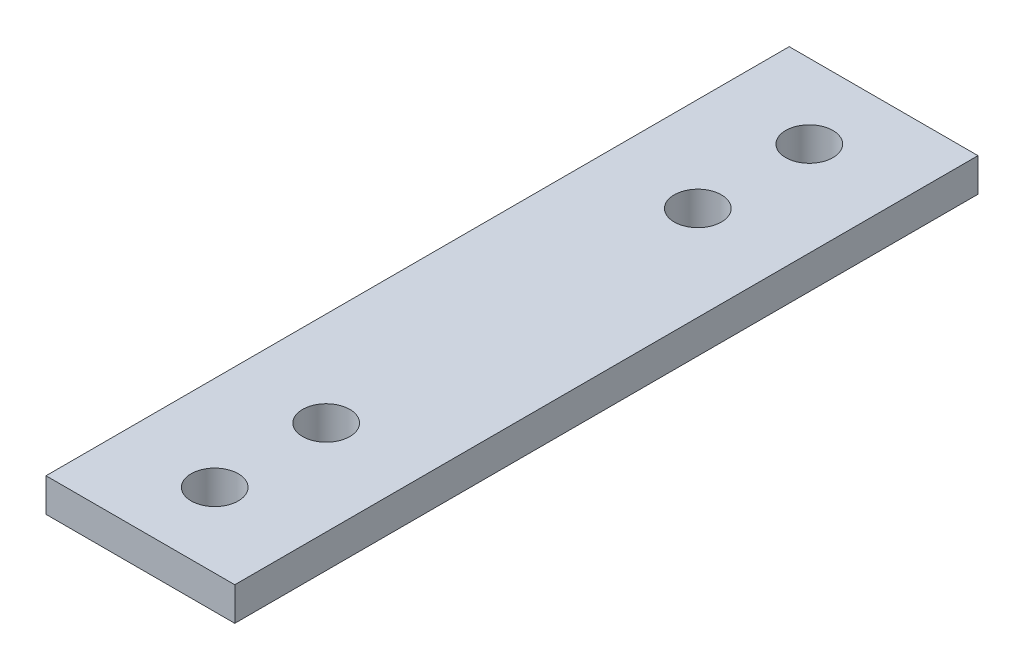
from build123d import *

# Parameters (mm, degrees)
CROQUIS1_W            = 25.4
CROQUIS1_H            = 100
EXTRUIR1_DEPTH        = 4.5
CORTAR_EXTRUIR1_REACH = 102.904
CROQUIS2_R            = 3.175


with BuildPart() as part:
    # Croquis1 → Extruir1 (new body)
    with BuildSketch(Plane(origin=(0, 0, 0), x_dir=(1, 0, 0), z_dir=(0, 1, 0))):
        with Locations((0, -50)):
            Rectangle(CROQUIS1_W, CROQUIS1_H)
    extrude(amount=EXTRUIR1_DEPTH)

    # Croquis2 → Cortar-Extruir1 (cut, up to next)
    with BuildSketch(Plane(origin=(0, 4.5, 0), x_dir=(-1, 0, 0), z_dir=(0, 1, 0)), mode=Mode.PRIVATE) as cortar_extruir1_sk1:
        with Locations(Location((0, 90, 0), (0, 0, 90))):
            Circle(CROQUIS2_R)
    cortar_extruir1_tool1 = extrude(cortar_extruir1_sk1.sketch, amount=-CORTAR_EXTRUIR1_REACH, mode=Mode.PRIVATE) & part.part
    # Croquis2 → Cortar-Extruir1 (cut, up to next)
    with BuildSketch(Plane(origin=(0, 4.5, 0), x_dir=(-1, 0, 0), z_dir=(0, 1, 0)), mode=Mode.PRIVATE) as cortar_extruir1_sk2:
        with Locations(Location((0, 75, 0), (0, 0, 90))):
            Circle(CROQUIS2_R)
    cortar_extruir1_tool2 = extrude(cortar_extruir1_sk2.sketch, amount=-CORTAR_EXTRUIR1_REACH, mode=Mode.PRIVATE) & part.part
    # Croquis2 → Cortar-Extruir1 (cut, up to next)
    with BuildSketch(Plane(origin=(0, 4.5, 0), x_dir=(-1, 0, 0), z_dir=(0, 1, 0)), mode=Mode.PRIVATE) as cortar_extruir1_sk3:
        with Locations(Location((0, 25, 0), (0, 0, 90))):
            Circle(CROQUIS2_R)
    cortar_extruir1_tool3 = extrude(cortar_extruir1_sk3.sketch, amount=-CORTAR_EXTRUIR1_REACH, mode=Mode.PRIVATE) & part.part
    # Croquis2 → Cortar-Extruir1 (cut, up to next)
    with BuildSketch(Plane(origin=(0, 4.5, 0), x_dir=(-1, 0, 0), z_dir=(0, 1, 0)), mode=Mode.PRIVATE) as cortar_extruir1_sk4:
        with Locations(Location((0, 10, 0), (0, 0, 90))):
            Circle(CROQUIS2_R)
    cortar_extruir1_tool4 = extrude(cortar_extruir1_sk4.sketch, amount=-CORTAR_EXTRUIR1_REACH, mode=Mode.PRIVATE) & part.part
    add(cortar_extruir1_tool1.solids().sort_by_distance((0, 4.5, 90))[0], mode=Mode.SUBTRACT)
    add(cortar_extruir1_tool2.solids().sort_by_distance((0, 4.5, 75))[0], mode=Mode.SUBTRACT)
    add(cortar_extruir1_tool3.solids().sort_by_distance((0, 4.5, 25))[0], mode=Mode.SUBTRACT)
    add(cortar_extruir1_tool4.solids().sort_by_distance((0, 4.5, 10))[0], mode=Mode.SUBTRACT)


solid = part.part
